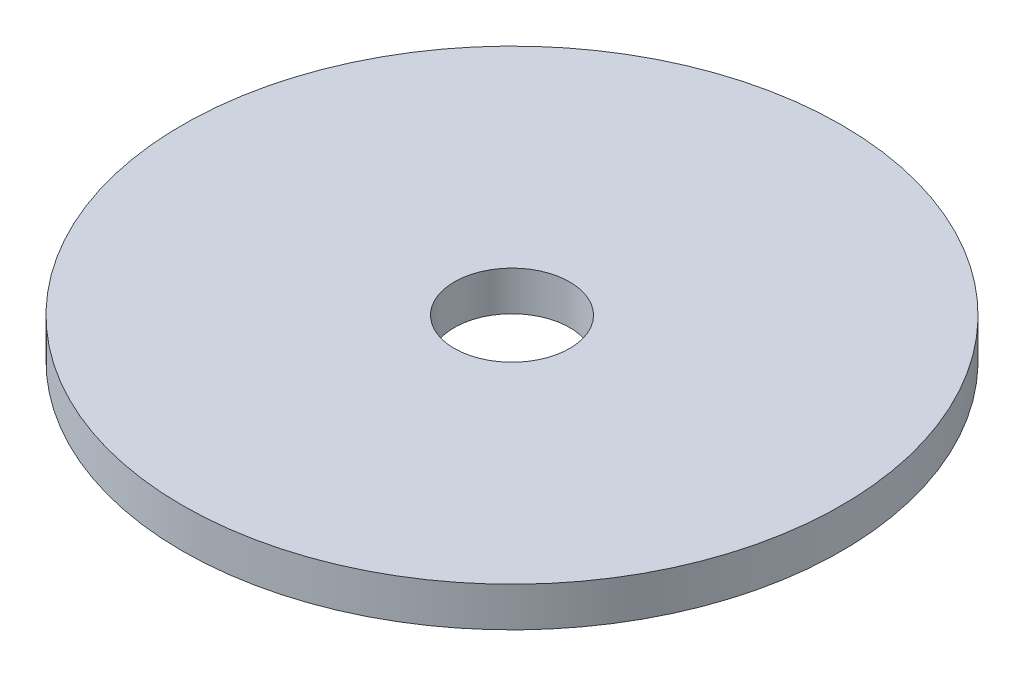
ISO-10303-21;
HEADER;
FILE_DESCRIPTION(('STEP AP214'),'2;1');
FILE_NAME('part.step','',(''),(''),'','','');
FILE_SCHEMA(('AUTOMOTIVE_DESIGN { 1 0 10303 214 1 1 1 1 }'));
ENDSEC;
DATA;
#1=APPLICATION_CONTEXT('core data for automotive mechanical design processes');
#2=APPLICATION_PROTOCOL_DEFINITION('international standard','automotive_design',2000,#1);
#3=PRODUCT_CONTEXT('',#1,'mechanical');
#4=PRODUCT('Part','Part','',(#3));
#5=PRODUCT_RELATED_PRODUCT_CATEGORY('part','',(#4));
#6=PRODUCT_DEFINITION_FORMATION('','',#4);
#7=PRODUCT_DEFINITION_CONTEXT('part definition',#1,'design');
#8=PRODUCT_DEFINITION('design','',#6,#7);
#9=PRODUCT_DEFINITION_SHAPE('','',#8);
#10=(LENGTH_UNIT() NAMED_UNIT(*) SI_UNIT(.MILLI.,.METRE.));
#11=(NAMED_UNIT(*) PLANE_ANGLE_UNIT() SI_UNIT($,.RADIAN.));
#12=(NAMED_UNIT(*) SI_UNIT($,.STERADIAN.) SOLID_ANGLE_UNIT());
#13=UNCERTAINTY_MEASURE_WITH_UNIT(LENGTH_MEASURE(1.E-05),#10,'distance_accuracy_value','');
#14=(GEOMETRIC_REPRESENTATION_CONTEXT(3) GLOBAL_UNCERTAINTY_ASSIGNED_CONTEXT((#13)) GLOBAL_UNIT_ASSIGNED_CONTEXT((#10,
#11,#12)) REPRESENTATION_CONTEXT('',''));
#15=CARTESIAN_POINT('',(0.,0.,0.));
#16=DIRECTION('',(0.,0.,1.));
#17=DIRECTION('',(1.,0.,0.));
#18=AXIS2_PLACEMENT_3D('',#15,#16,#17);
#19=CARTESIAN_POINT('',(0.,1.2,0.));
#20=DIRECTION('',(0.,1.,0.));
#21=DIRECTION('',(0.,0.,1.));
#22=AXIS2_PLACEMENT_3D('',#19,#20,#21);
#23=PLANE('',#22);
#24=CARTESIAN_POINT('',(0.,1.2,0.));
#25=DIRECTION('',(0.,1.,0.));
#26=DIRECTION('',(0.,0.,1.));
#27=AXIS2_PLACEMENT_3D('',#24,#25,#26);
#28=CIRCLE('',#27,10.);
#29=CARTESIAN_POINT('',(0.,1.2,10.));
#30=VERTEX_POINT('',#29);
#31=EDGE_CURVE('E10',#30,#30,#28,.T.);
#32=ORIENTED_EDGE('',*,*,#31,.T.);
#33=EDGE_LOOP('',(#32));
#34=FACE_BOUND('',#33,.T.);
#35=CARTESIAN_POINT('',(0.,1.2,0.));
#36=DIRECTION('',(0.,1.,0.));
#37=DIRECTION('',(0.,0.,1.));
#38=AXIS2_PLACEMENT_3D('',#35,#36,#37);
#39=CIRCLE('',#38,1.75);
#40=CARTESIAN_POINT('',(0.,1.2,1.75));
#41=VERTEX_POINT('',#40);
#42=EDGE_CURVE('E50',#41,#41,#39,.T.);
#43=ORIENTED_EDGE('',*,*,#42,.F.);
#44=EDGE_LOOP('',(#43));
#45=FACE_BOUND('',#44,.T.);
#46=ADVANCED_FACE('F37',(#34,#45),#23,.T.);
#47=CARTESIAN_POINT('',(0.,0.,0.));
#48=DIRECTION('',(0.,1.,0.));
#49=DIRECTION('',(0.,0.,1.));
#50=AXIS2_PLACEMENT_3D('',#47,#48,#49);
#51=PLANE('',#50);
#52=CARTESIAN_POINT('',(0.,0.,0.));
#53=DIRECTION('',(0.,1.,0.));
#54=DIRECTION('',(0.,0.,1.));
#55=AXIS2_PLACEMENT_3D('',#52,#53,#54);
#56=CIRCLE('',#55,10.);
#57=CARTESIAN_POINT('',(0.,0.,10.));
#58=VERTEX_POINT('',#57);
#59=EDGE_CURVE('E41',#58,#58,#56,.T.);
#60=ORIENTED_EDGE('',*,*,#59,.F.);
#61=EDGE_LOOP('',(#60));
#62=FACE_BOUND('',#61,.T.);
#63=CARTESIAN_POINT('',(0.,0.,0.));
#64=DIRECTION('',(0.,1.,0.));
#65=DIRECTION('',(0.,0.,1.));
#66=AXIS2_PLACEMENT_3D('',#63,#64,#65);
#67=CIRCLE('',#66,1.75);
#68=CARTESIAN_POINT('',(0.,0.,1.75));
#69=VERTEX_POINT('',#68);
#70=EDGE_CURVE('E52',#69,#69,#67,.T.);
#71=ORIENTED_EDGE('',*,*,#70,.T.);
#72=EDGE_LOOP('',(#71));
#73=FACE_BOUND('',#72,.T.);
#74=ADVANCED_FACE('F64',(#62,#73),#51,.F.);
#75=CARTESIAN_POINT('',(0.,1.2,0.));
#76=DIRECTION('',(0.,-1.,0.));
#77=DIRECTION('',(0.,0.,-1.));
#78=AXIS2_PLACEMENT_3D('',#75,#76,#77);
#79=CYLINDRICAL_SURFACE('',#78,10.);
#80=ORIENTED_EDGE('',*,*,#31,.F.);
#81=EDGE_LOOP('',(#80));
#82=FACE_BOUND('',#81,.T.);
#83=ORIENTED_EDGE('',*,*,#59,.T.);
#84=EDGE_LOOP('',(#83));
#85=FACE_BOUND('',#84,.T.);
#86=ADVANCED_FACE('F39',(#82,#85),#79,.T.);
#87=CARTESIAN_POINT('',(0.,1.2,0.));
#88=DIRECTION('',(0.,-1.,0.));
#89=DIRECTION('',(0.,0.,-1.));
#90=AXIS2_PLACEMENT_3D('',#87,#88,#89);
#91=CYLINDRICAL_SURFACE('',#90,1.75);
#92=ORIENTED_EDGE('',*,*,#42,.T.);
#93=EDGE_LOOP('',(#92));
#94=FACE_BOUND('',#93,.T.);
#95=ORIENTED_EDGE('',*,*,#70,.F.);
#96=EDGE_LOOP('',(#95));
#97=FACE_BOUND('',#96,.T.);
#98=ADVANCED_FACE('F60',(#94,#97),#91,.F.);
#99=CLOSED_SHELL('',(#46,#74,#86,#98));
#100=MANIFOLD_SOLID_BREP('B2',#99);
#101=ADVANCED_BREP_SHAPE_REPRESENTATION('',(#18,#100),#14);
#102=SHAPE_DEFINITION_REPRESENTATION(#9,#101);
ENDSEC;
END-ISO-10303-21;
